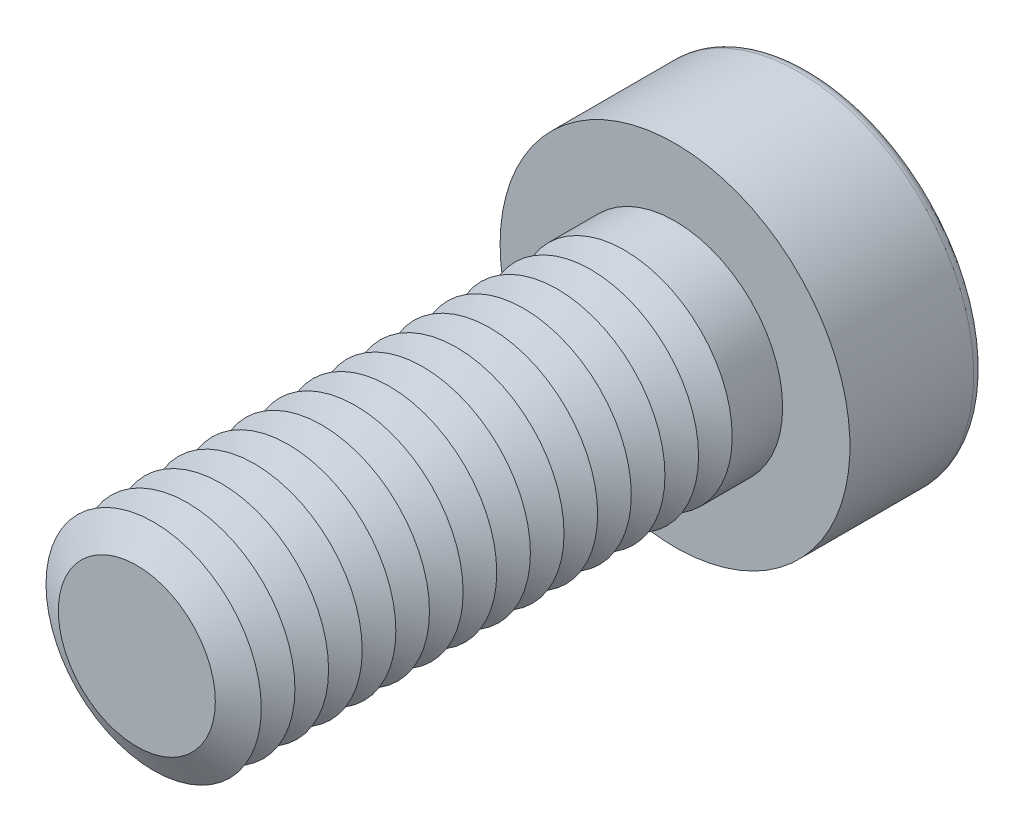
from build123d import *

# Parameters (mm, degrees)
SKETCH1_R           = 4
BOSS_EXTRUDE1_DEPTH = 20
SKETCH2_R           = 6.5
BOSS_EXTRUDE2_DEPTH = 5
CUT_EXTRUDE1_DEPTH  = 3.75
FILLET1_R           = 0.4
LPATTERN1_COUNT     = 15
LPATTERN1_PITCH     = 1.25


with BuildPart() as part:
    # Sketch1 → Boss-Extrude1 (new body)
    with BuildSketch(Plane.XY):
        Circle(SKETCH1_R)
    extrude(amount=BOSS_EXTRUDE1_DEPTH)

    # Sketch2 → Boss-Extrude2 (add)
    with BuildSketch(Plane(origin=(0, 0, 0), x_dir=(-1, 0, 0), z_dir=(0, 0, -1))):
        Circle(SKETCH2_R)
    extrude(amount=BOSS_EXTRUDE2_DEPTH)

    # Sketch3 → Cut-Extrude1 (cut)
    with BuildSketch(Plane(origin=(0, 0, -5), x_dir=(-1, 0, 0), z_dir=(0, 0, -1))):
        Polygon((-1.443375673, 2.5), (-2.886751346, 0), (-1.443375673, -2.5), (1.443375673, -2.5), (2.886751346, 0), (1.443375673, 2.5), align=None)
    extrude(amount=-CUT_EXTRUDE1_DEPTH, mode=Mode.SUBTRACT)

    # Fillet1
    fillet1_edges = [part.edges().sort_by_distance(p)[0] for p in [
        (6.5, 0, -5),
    ]]
    fillet(fillet1_edges, radius=FILLET1_R)

    # Cut-Extrude2 cone 1 section (on through the dimple's axis) → Cut-Extrude2 (revolve, cut)
    with BuildSketch(Plane(origin=(0, 0, -1.25), x_dir=(0, 1, 0), z_dir=(1, 0, 0))):
        Polygon((0, 0), (2.5, 0), (0, 1.443375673), align=None)
    revolve(axis=Axis((0, 0, -1.25), (0, 0, 1)), mode=Mode.SUBTRACT)

    # Cut-Extrude3 cone 1 section (on through the dimple's axis) → Cut-Extrude3 (revolve, cut)
    with BuildSketch(Plane(origin=(0, 0, -5), x_dir=(0, 1, 0), z_dir=(1, 0, 0))):
        Polygon((0, 0), (2.886751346, 0), (0, 0.773502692), align=None)
    revolve(axis=Axis((0, 0, -5), (0, 0, 1)), mode=Mode.SUBTRACT)

    # Sketch7 → Cut-Revolve1 (revolve, cut)
    with BuildSketch(Plane(origin=(0, 0, 0), x_dir=(0, 0, -1), z_dir=(1, 0, 0)), mode=Mode.PRIVATE) as cut_revolve1_sk:
        Polygon((-20, 2.917468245), (-19.375, 4), (-20.625, 4), align=None)
    cut_revolve1 = revolve(cut_revolve1_sk.sketch.rotate(Axis((0, 0, 20), (0, 0, -1)), 90), axis=Axis((0, 0, 20), (0, 0, -1)), mode=Mode.SUBTRACT)

    # LPattern1: Cut-Revolve1 ×15
    with Locations(*[(0, 0, -i * LPATTERN1_PITCH) for i in range(1, LPATTERN1_COUNT)]):
        add(cut_revolve1, mode=Mode.SUBTRACT)


solid = part.part
